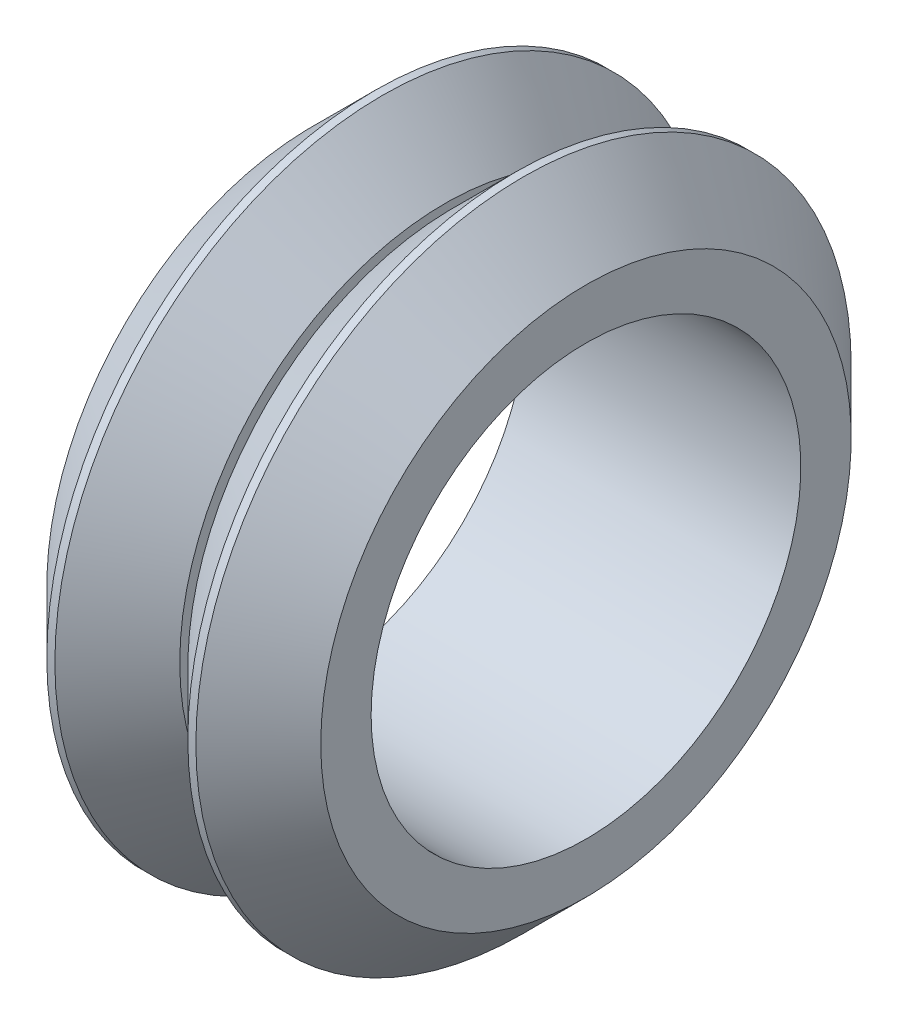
ISO-10303-21;
HEADER;
FILE_DESCRIPTION(('STEP AP214'),'2;1');
FILE_NAME('part.step','',(''),(''),'','','');
FILE_SCHEMA(('AUTOMOTIVE_DESIGN { 1 0 10303 214 1 1 1 1 }'));
ENDSEC;
DATA;
#1=APPLICATION_CONTEXT('core data for automotive mechanical design processes');
#2=APPLICATION_PROTOCOL_DEFINITION('international standard','automotive_design',2000,#1);
#3=PRODUCT_CONTEXT('',#1,'mechanical');
#4=PRODUCT('Part','Part','',(#3));
#5=PRODUCT_RELATED_PRODUCT_CATEGORY('part','',(#4));
#6=PRODUCT_DEFINITION_FORMATION('','',#4);
#7=PRODUCT_DEFINITION_CONTEXT('part definition',#1,'design');
#8=PRODUCT_DEFINITION('design','',#6,#7);
#9=PRODUCT_DEFINITION_SHAPE('','',#8);
#10=(LENGTH_UNIT() NAMED_UNIT(*) SI_UNIT(.MILLI.,.METRE.));
#11=(NAMED_UNIT(*) PLANE_ANGLE_UNIT() SI_UNIT($,.RADIAN.));
#12=(NAMED_UNIT(*) SI_UNIT($,.STERADIAN.) SOLID_ANGLE_UNIT());
#13=UNCERTAINTY_MEASURE_WITH_UNIT(LENGTH_MEASURE(1.E-05),#10,'distance_accuracy_value','');
#14=(GEOMETRIC_REPRESENTATION_CONTEXT(3) GLOBAL_UNCERTAINTY_ASSIGNED_CONTEXT((#13)) GLOBAL_UNIT_ASSIGNED_CONTEXT((#10,
#11,#12)) REPRESENTATION_CONTEXT('',''));
#15=CARTESIAN_POINT('',(0.,0.,0.));
#16=DIRECTION('',(0.,0.,1.));
#17=DIRECTION('',(1.,0.,0.));
#18=AXIS2_PLACEMENT_3D('',#15,#16,#17);
#19=CARTESIAN_POINT('',(0.,0.,0.));
#20=DIRECTION('',(-1.,0.,0.));
#21=DIRECTION('',(0.,0.,1.));
#22=AXIS2_PLACEMENT_3D('',#19,#20,#21);
#23=CYLINDRICAL_SURFACE('',#22,9.37499999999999);
#24=CARTESIAN_POINT('',(0.150000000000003,0.,0.));
#25=DIRECTION('',(-1.,0.,0.));
#26=DIRECTION('',(0.,0.,1.));
#27=AXIS2_PLACEMENT_3D('',#24,#25,#26);
#28=CIRCLE('',#27,9.37499999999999);
#29=CARTESIAN_POINT('',(0.150000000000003,0.,9.37499999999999));
#30=VERTEX_POINT('',#29);
#31=EDGE_CURVE('E44',#30,#30,#28,.F.);
#32=ORIENTED_EDGE('',*,*,#31,.F.);
#33=EDGE_LOOP('',(#32));
#34=FACE_BOUND('',#33,.T.);
#35=CARTESIAN_POINT('',(-0.15,0.,0.));
#36=DIRECTION('',(-1.,0.,0.));
#37=DIRECTION('',(0.,0.,1.));
#38=AXIS2_PLACEMENT_3D('',#35,#36,#37);
#39=CIRCLE('',#38,9.37499999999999);
#40=CARTESIAN_POINT('',(-0.15,0.,9.37499999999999));
#41=VERTEX_POINT('',#40);
#42=EDGE_CURVE('E18',#41,#41,#39,.T.);
#43=ORIENTED_EDGE('',*,*,#42,.F.);
#44=EDGE_LOOP('',(#43));
#45=FACE_BOUND('',#44,.T.);
#46=ADVANCED_FACE('F15',(#34,#45),#23,.T.);
#47=CARTESIAN_POINT('',(-0.150000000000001,0.,0.));
#48=DIRECTION('',(1.,0.,0.));
#49=DIRECTION('',(0.,0.,-1.));
#50=AXIS2_PLACEMENT_3D('',#47,#48,#49);
#51=PLANE('',#50);
#52=CARTESIAN_POINT('',(-0.150000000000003,0.,0.));
#53=DIRECTION('',(-1.,0.,0.));
#54=DIRECTION('',(0.,0.,1.));
#55=AXIS2_PLACEMENT_3D('',#52,#53,#54);
#56=CIRCLE('',#55,9.87499999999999);
#57=CARTESIAN_POINT('',(-0.150000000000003,0.,9.87499999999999));
#58=VERTEX_POINT('',#57);
#59=EDGE_CURVE('E42',#58,#58,#56,.T.);
#60=ORIENTED_EDGE('',*,*,#59,.F.);
#61=EDGE_LOOP('',(#60));
#62=FACE_BOUND('',#61,.T.);
#63=ORIENTED_EDGE('',*,*,#42,.T.);
#64=EDGE_LOOP('',(#63));
#65=FACE_BOUND('',#64,.T.);
#66=ADVANCED_FACE('F51',(#62,#65),#51,.T.);
#67=CARTESIAN_POINT('',(0.150000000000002,0.,0.));
#68=DIRECTION('',(-1.,0.,0.));
#69=DIRECTION('',(0.,0.,1.));
#70=AXIS2_PLACEMENT_3D('',#67,#68,#69);
#71=PLANE('',#70);
#72=ORIENTED_EDGE('',*,*,#31,.T.);
#73=EDGE_LOOP('',(#72));
#74=FACE_BOUND('',#73,.T.);
#75=CARTESIAN_POINT('',(0.150000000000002,0.,0.));
#76=DIRECTION('',(1.,0.,0.));
#77=DIRECTION('',(0.,0.,-1.));
#78=AXIS2_PLACEMENT_3D('',#75,#76,#77);
#79=CIRCLE('',#78,9.87499999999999);
#80=CARTESIAN_POINT('',(0.150000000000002,0.,-9.87499999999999));
#81=VERTEX_POINT('',#80);
#82=EDGE_CURVE('E39',#81,#81,#79,.T.);
#83=ORIENTED_EDGE('',*,*,#82,.F.);
#84=EDGE_LOOP('',(#83));
#85=FACE_BOUND('',#84,.T.);
#86=ADVANCED_FACE('F59',(#74,#85),#71,.T.);
#87=CARTESIAN_POINT('',(-2.475,0.,0.));
#88=DIRECTION('',(-1.,0.,0.));
#89=DIRECTION('',(0.,0.,1.));
#90=AXIS2_PLACEMENT_3D('',#87,#88,#89);
#91=CONICAL_SURFACE('',#90,12.2,0.78539816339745);
#92=ORIENTED_EDGE('',*,*,#59,.T.);
#93=EDGE_LOOP('',(#92));
#94=FACE_BOUND('',#93,.T.);
#95=CARTESIAN_POINT('',(-2.475,0.,0.));
#96=DIRECTION('',(-1.,0.,0.));
#97=DIRECTION('',(0.,0.,1.));
#98=AXIS2_PLACEMENT_3D('',#95,#96,#97);
#99=CIRCLE('',#98,12.2);
#100=CARTESIAN_POINT('',(-2.475,0.,12.2));
#101=VERTEX_POINT('',#100);
#102=EDGE_CURVE('E30',#101,#101,#99,.T.);
#103=ORIENTED_EDGE('',*,*,#102,.F.);
#104=EDGE_LOOP('',(#103));
#105=FACE_BOUND('',#104,.T.);
#106=ADVANCED_FACE('F97',(#94,#105),#91,.T.);
#107=CARTESIAN_POINT('',(2.475,0.,0.));
#108=DIRECTION('',(1.,0.,0.));
#109=DIRECTION('',(0.,0.,-1.));
#110=AXIS2_PLACEMENT_3D('',#107,#108,#109);
#111=CONICAL_SURFACE('',#110,12.2,0.78539816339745);
#112=ORIENTED_EDGE('',*,*,#82,.T.);
#113=EDGE_LOOP('',(#112));
#114=FACE_BOUND('',#113,.T.);
#115=CARTESIAN_POINT('',(2.475,0.,0.));
#116=DIRECTION('',(-1.,0.,0.));
#117=DIRECTION('',(0.,0.,1.));
#118=AXIS2_PLACEMENT_3D('',#115,#116,#117);
#119=CIRCLE('',#118,12.2);
#120=CARTESIAN_POINT('',(2.475,0.,12.2));
#121=VERTEX_POINT('',#120);
#122=EDGE_CURVE('E110',#121,#121,#119,.F.);
#123=ORIENTED_EDGE('',*,*,#122,.F.);
#124=EDGE_LOOP('',(#123));
#125=FACE_BOUND('',#124,.T.);
#126=ADVANCED_FACE('F93',(#114,#125),#111,.T.);
#127=CARTESIAN_POINT('',(0.,0.,0.));
#128=DIRECTION('',(-1.,0.,0.));
#129=DIRECTION('',(0.,0.,1.));
#130=AXIS2_PLACEMENT_3D('',#127,#128,#129);
#131=CYLINDRICAL_SURFACE('',#130,12.2);
#132=ORIENTED_EDGE('',*,*,#102,.T.);
#133=EDGE_LOOP('',(#132));
#134=FACE_BOUND('',#133,.T.);
#135=CARTESIAN_POINT('',(-2.775,0.,0.));
#136=DIRECTION('',(1.,0.,0.));
#137=DIRECTION('',(0.,0.,-1.));
#138=AXIS2_PLACEMENT_3D('',#135,#136,#137);
#139=CIRCLE('',#138,12.2);
#140=CARTESIAN_POINT('',(-2.775,0.,-12.2));
#141=VERTEX_POINT('',#140);
#142=EDGE_CURVE('E112',#141,#141,#139,.F.);
#143=ORIENTED_EDGE('',*,*,#142,.F.);
#144=EDGE_LOOP('',(#143));
#145=FACE_BOUND('',#144,.T.);
#146=ADVANCED_FACE('F89',(#134,#145),#131,.T.);
#147=CARTESIAN_POINT('',(0.,0.,0.));
#148=DIRECTION('',(-1.,0.,0.));
#149=DIRECTION('',(0.,0.,1.));
#150=AXIS2_PLACEMENT_3D('',#147,#148,#149);
#151=CYLINDRICAL_SURFACE('',#150,12.2);
#152=CARTESIAN_POINT('',(2.775,0.,0.));
#153=DIRECTION('',(-1.,0.,0.));
#154=DIRECTION('',(0.,0.,1.));
#155=AXIS2_PLACEMENT_3D('',#152,#153,#154);
#156=CIRCLE('',#155,12.2);
#157=CARTESIAN_POINT('',(2.775,0.,12.2));
#158=VERTEX_POINT('',#157);
#159=EDGE_CURVE('E38',#158,#158,#156,.F.);
#160=ORIENTED_EDGE('',*,*,#159,.F.);
#161=EDGE_LOOP('',(#160));
#162=FACE_BOUND('',#161,.T.);
#163=ORIENTED_EDGE('',*,*,#122,.T.);
#164=EDGE_LOOP('',(#163));
#165=FACE_BOUND('',#164,.T.);
#166=ADVANCED_FACE('F85',(#162,#165),#151,.T.);
#167=CARTESIAN_POINT('',(-2.775,0.,0.));
#168=DIRECTION('',(1.,0.,0.));
#169=DIRECTION('',(0.,0.,-1.));
#170=AXIS2_PLACEMENT_3D('',#167,#168,#169);
#171=CONICAL_SURFACE('',#170,12.2,0.78539816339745);
#172=CARTESIAN_POINT('',(-5.1,0.,0.));
#173=DIRECTION('',(1.,0.,0.));
#174=DIRECTION('',(0.,0.,-1.));
#175=AXIS2_PLACEMENT_3D('',#172,#173,#174);
#176=CIRCLE('',#175,9.87499999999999);
#177=CARTESIAN_POINT('',(-5.1,0.,-9.87499999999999));
#178=VERTEX_POINT('',#177);
#179=EDGE_CURVE('E35',#178,#178,#176,.T.);
#180=ORIENTED_EDGE('',*,*,#179,.T.);
#181=EDGE_LOOP('',(#180));
#182=FACE_BOUND('',#181,.T.);
#183=ORIENTED_EDGE('',*,*,#142,.T.);
#184=EDGE_LOOP('',(#183));
#185=FACE_BOUND('',#184,.T.);
#186=ADVANCED_FACE('F81',(#182,#185),#171,.T.);
#187=CARTESIAN_POINT('',(2.775,0.,0.));
#188=DIRECTION('',(-1.,0.,0.));
#189=DIRECTION('',(0.,0.,1.));
#190=AXIS2_PLACEMENT_3D('',#187,#188,#189);
#191=CONICAL_SURFACE('',#190,12.2,0.785398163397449);
#192=CARTESIAN_POINT('',(5.1,0.,0.));
#193=DIRECTION('',(-1.,0.,0.));
#194=DIRECTION('',(0.,0.,1.));
#195=AXIS2_PLACEMENT_3D('',#192,#193,#194);
#196=CIRCLE('',#195,9.87499999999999);
#197=CARTESIAN_POINT('',(5.1,0.,9.87499999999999));
#198=VERTEX_POINT('',#197);
#199=EDGE_CURVE('E27',#198,#198,#196,.F.);
#200=ORIENTED_EDGE('',*,*,#199,.F.);
#201=EDGE_LOOP('',(#200));
#202=FACE_BOUND('',#201,.T.);
#203=ORIENTED_EDGE('',*,*,#159,.T.);
#204=EDGE_LOOP('',(#203));
#205=FACE_BOUND('',#204,.T.);
#206=ADVANCED_FACE('F77',(#202,#205),#191,.T.);
#207=CARTESIAN_POINT('',(-5.1,0.,0.));
#208=DIRECTION('',(1.,0.,0.));
#209=DIRECTION('',(0.,0.,-1.));
#210=AXIS2_PLACEMENT_3D('',#207,#208,#209);
#211=PLANE('',#210);
#212=ORIENTED_EDGE('',*,*,#179,.F.);
#213=EDGE_LOOP('',(#212));
#214=FACE_BOUND('',#213,.T.);
#215=CARTESIAN_POINT('',(-5.1,0.,0.));
#216=DIRECTION('',(-1.,0.,0.));
#217=DIRECTION('',(0.,0.,1.));
#218=AXIS2_PLACEMENT_3D('',#215,#216,#217);
#219=CIRCLE('',#218,8.);
#220=CARTESIAN_POINT('',(-5.1,0.,8.));
#221=VERTEX_POINT('',#220);
#222=EDGE_CURVE('E22',#221,#221,#219,.F.);
#223=ORIENTED_EDGE('',*,*,#222,.T.);
#224=EDGE_LOOP('',(#223));
#225=FACE_BOUND('',#224,.T.);
#226=ADVANCED_FACE('F69',(#214,#225),#211,.F.);
#227=CARTESIAN_POINT('',(5.1,0.,0.));
#228=DIRECTION('',(1.,0.,0.));
#229=DIRECTION('',(0.,0.,-1.));
#230=AXIS2_PLACEMENT_3D('',#227,#228,#229);
#231=PLANE('',#230);
#232=ORIENTED_EDGE('',*,*,#199,.T.);
#233=EDGE_LOOP('',(#232));
#234=FACE_BOUND('',#233,.T.);
#235=CARTESIAN_POINT('',(5.1,0.,0.));
#236=DIRECTION('',(-1.,0.,0.));
#237=DIRECTION('',(0.,0.,1.));
#238=AXIS2_PLACEMENT_3D('',#235,#236,#237);
#239=CIRCLE('',#238,8.);
#240=CARTESIAN_POINT('',(5.1,0.,8.));
#241=VERTEX_POINT('',#240);
#242=EDGE_CURVE('E10',#241,#241,#239,.T.);
#243=ORIENTED_EDGE('',*,*,#242,.T.);
#244=EDGE_LOOP('',(#243));
#245=FACE_BOUND('',#244,.T.);
#246=ADVANCED_FACE('F63',(#234,#245),#231,.T.);
#247=CARTESIAN_POINT('',(0.,0.,0.));
#248=DIRECTION('',(-1.,0.,0.));
#249=DIRECTION('',(0.,0.,1.));
#250=AXIS2_PLACEMENT_3D('',#247,#248,#249);
#251=CYLINDRICAL_SURFACE('',#250,8.);
#252=ORIENTED_EDGE('',*,*,#222,.F.);
#253=EDGE_LOOP('',(#252));
#254=FACE_BOUND('',#253,.T.);
#255=ORIENTED_EDGE('',*,*,#242,.F.);
#256=EDGE_LOOP('',(#255));
#257=FACE_BOUND('',#256,.T.);
#258=ADVANCED_FACE('F61',(#254,#257),#251,.F.);
#259=CLOSED_SHELL('',(#46,#66,#86,#106,#126,#146,#166,#186,#206,#226,#246,#258));
#260=MANIFOLD_SOLID_BREP('B1',#259);
#261=ADVANCED_BREP_SHAPE_REPRESENTATION('',(#18,#260),#14);
#262=SHAPE_DEFINITION_REPRESENTATION(#9,#261);
ENDSEC;
END-ISO-10303-21;
